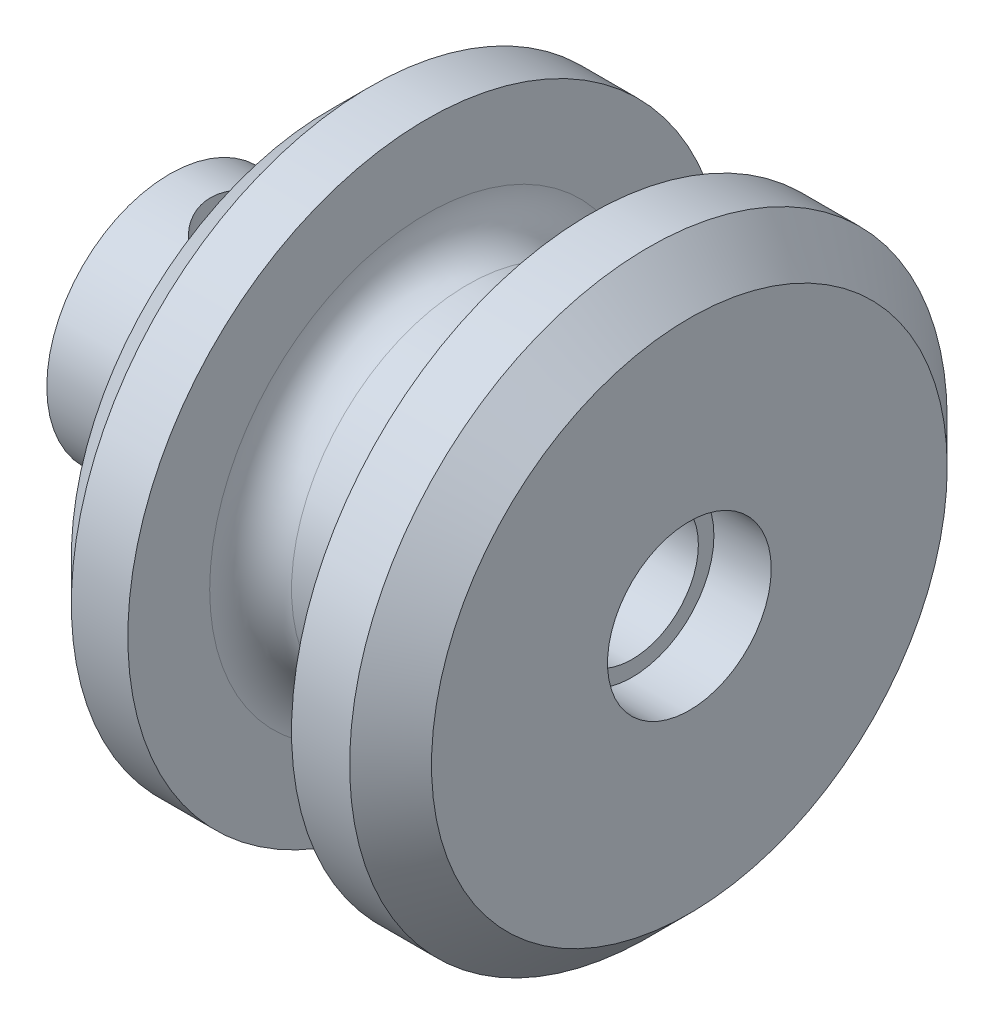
ISO-10303-21;
HEADER;
FILE_DESCRIPTION(('STEP AP214'),'2;1');
FILE_NAME('part.step','',(''),(''),'','','');
FILE_SCHEMA(('AUTOMOTIVE_DESIGN { 1 0 10303 214 1 1 1 1 }'));
ENDSEC;
DATA;
#1=APPLICATION_CONTEXT('core data for automotive mechanical design processes');
#2=APPLICATION_PROTOCOL_DEFINITION('international standard','automotive_design',2000,#1);
#3=PRODUCT_CONTEXT('',#1,'mechanical');
#4=PRODUCT('Part','Part','',(#3));
#5=PRODUCT_RELATED_PRODUCT_CATEGORY('part','',(#4));
#6=PRODUCT_DEFINITION_FORMATION('','',#4);
#7=PRODUCT_DEFINITION_CONTEXT('part definition',#1,'design');
#8=PRODUCT_DEFINITION('design','',#6,#7);
#9=PRODUCT_DEFINITION_SHAPE('','',#8);
#10=(LENGTH_UNIT() NAMED_UNIT(*) SI_UNIT(.MILLI.,.METRE.));
#11=(NAMED_UNIT(*) PLANE_ANGLE_UNIT() SI_UNIT($,.RADIAN.));
#12=(NAMED_UNIT(*) SI_UNIT($,.STERADIAN.) SOLID_ANGLE_UNIT());
#13=UNCERTAINTY_MEASURE_WITH_UNIT(LENGTH_MEASURE(1.E-05),#10,'distance_accuracy_value','');
#14=(GEOMETRIC_REPRESENTATION_CONTEXT(3) GLOBAL_UNCERTAINTY_ASSIGNED_CONTEXT((#13)) GLOBAL_UNIT_ASSIGNED_CONTEXT((#10,
#11,#12)) REPRESENTATION_CONTEXT('',''));
#15=CARTESIAN_POINT('',(0.,0.,0.));
#16=DIRECTION('',(0.,0.,1.));
#17=DIRECTION('',(1.,0.,0.));
#18=AXIS2_PLACEMENT_3D('',#15,#16,#17);
#19=CARTESIAN_POINT('',(0.,0.,0.));
#20=DIRECTION('',(-1.,0.,0.));
#21=DIRECTION('',(0.,0.,1.));
#22=AXIS2_PLACEMENT_3D('',#19,#20,#21);
#23=PLANE('',#22);
#24=CARTESIAN_POINT('',(0.,0.,0.));
#25=DIRECTION('',(1.,0.,0.));
#26=DIRECTION('',(0.,0.,-1.));
#27=AXIS2_PLACEMENT_3D('',#24,#25,#26);
#28=CIRCLE('',#27,1.62);
#29=CARTESIAN_POINT('',(0.,0.,-1.62));
#30=VERTEX_POINT('',#29);
#31=EDGE_CURVE('E454',#30,#30,#28,.T.);
#32=ORIENTED_EDGE('',*,*,#31,.T.);
#33=EDGE_LOOP('',(#32));
#34=FACE_BOUND('',#33,.T.);
#35=CARTESIAN_POINT('',(0.,0.,0.));
#36=DIRECTION('',(1.,0.,0.));
#37=DIRECTION('',(0.,0.,-1.));
#38=AXIS2_PLACEMENT_3D('',#35,#36,#37);
#39=CIRCLE('',#38,3.);
#40=CARTESIAN_POINT('',(0.,0.,-3.));
#41=VERTEX_POINT('',#40);
#42=EDGE_CURVE('E11',#41,#41,#39,.T.);
#43=ORIENTED_EDGE('',*,*,#42,.F.);
#44=EDGE_LOOP('',(#43));
#45=FACE_BOUND('',#44,.T.);
#46=ADVANCED_FACE('F350',(#34,#45),#23,.T.);
#47=CARTESIAN_POINT('',(0.,0.,0.));
#48=DIRECTION('',(1.,0.,0.));
#49=DIRECTION('',(0.,0.,-1.));
#50=AXIS2_PLACEMENT_3D('',#47,#48,#49);
#51=CYLINDRICAL_SURFACE('',#50,3.);
#52=CARTESIAN_POINT('',(2.5,2.71108834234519,-1.28452325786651));
#53=CARTESIAN_POINT('',(2.46677037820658,2.70863288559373,-1.28969830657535));
#54=CARTESIAN_POINT('',(2.4333102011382,2.70677714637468,-1.29358504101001));
#55=CARTESIAN_POINT('',(2.36614828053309,2.70430257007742,-1.29875296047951));
#56=CARTESIAN_POINT('',(2.3324465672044,2.70368358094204,-1.30003446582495));
#57=CARTESIAN_POINT('',(2.23161316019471,2.70373706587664,-1.29992953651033));
#58=CARTESIAN_POINT('',(2.16443658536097,2.70629625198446,-1.29464275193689));
#59=CARTESIAN_POINT('',(2.03208856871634,2.71613788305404,-1.27386032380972));
#60=CARTESIAN_POINT('',(1.9669172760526,2.72342067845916,-1.25836392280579));
#61=CARTESIAN_POINT('',(1.84017654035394,2.74180577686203,-1.21778223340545));
#62=CARTESIAN_POINT('',(1.77860950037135,2.75291059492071,-1.19269062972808));
#63=CARTESIAN_POINT('',(1.65829903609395,2.7781631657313,-1.13265323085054));
#64=CARTESIAN_POINT('',(1.59973730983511,2.79240615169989,-1.09738491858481));
#65=CARTESIAN_POINT('',(1.48903998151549,2.82219927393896,-1.01831967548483));
#66=CARTESIAN_POINT('',(1.43690769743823,2.8377500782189,-0.974518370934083));
#67=CARTESIAN_POINT('',(1.33583958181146,2.87003723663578,-0.875125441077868));
#68=CARTESIAN_POINT('',(1.28757967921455,2.88675862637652,-0.818838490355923));
#69=CARTESIAN_POINT('',(1.20110220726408,2.91821029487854,-0.698506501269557));
#70=CARTESIAN_POINT('',(1.16288437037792,2.9329406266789,-0.634461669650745));
#71=CARTESIAN_POINT('',(1.097856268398,2.9587598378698,-0.500380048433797));
#72=CARTESIAN_POINT('',(1.07100879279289,2.96986056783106,-0.43036371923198));
#73=CARTESIAN_POINT('',(1.02968562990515,2.98719645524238,-0.286205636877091));
#74=CARTESIAN_POINT('',(1.01520217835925,2.99343466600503,-0.212066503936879));
#75=CARTESIAN_POINT('',(0.99990621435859,3.00003376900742,-0.0678761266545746));
#76=CARTESIAN_POINT('',(0.998135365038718,3.00080659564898,0.0020556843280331));
#77=CARTESIAN_POINT('',(1.00581281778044,2.99748358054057,0.141174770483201));
#78=CARTESIAN_POINT('',(1.01525936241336,2.99338850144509,0.210362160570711));
#79=CARTESIAN_POINT('',(1.04444703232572,2.9809810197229,0.343635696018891));
#80=CARTESIAN_POINT('',(1.06382919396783,2.97281592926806,0.407815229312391));
#81=CARTESIAN_POINT('',(1.11196812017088,2.95312354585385,0.53199397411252));
#82=CARTESIAN_POINT('',(1.14072651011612,2.94159566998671,0.591992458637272));
#83=CARTESIAN_POINT('',(1.20846178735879,2.91554962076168,0.709490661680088));
#84=CARTESIAN_POINT('',(1.24788779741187,2.90090823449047,0.766703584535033));
#85=CARTESIAN_POINT('',(1.33514170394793,2.8704148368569,0.873976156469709));
#86=CARTESIAN_POINT('',(1.38297436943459,2.85456214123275,0.924031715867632));
#87=CARTESIAN_POINT('',(1.48976719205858,2.8220045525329,1.01931671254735));
#88=CARTESIAN_POINT('',(1.54928239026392,2.80532110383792,1.06393396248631));
#89=CARTESIAN_POINT('',(1.67548890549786,2.77421776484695,1.14258955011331));
#90=CARTESIAN_POINT('',(1.74217958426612,2.75979767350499,1.17662882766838));
#91=CARTESIAN_POINT('',(1.88038263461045,2.73523498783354,1.23264824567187));
#92=CARTESIAN_POINT('',(1.95183764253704,2.72504946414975,1.25475012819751));
#93=CARTESIAN_POINT('',(2.09800712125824,2.71026751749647,1.28637743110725));
#94=CARTESIAN_POINT('',(2.17271668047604,2.70566295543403,1.29592116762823));
#95=CARTESIAN_POINT('',(2.28988147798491,2.70338789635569,1.30065001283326));
#96=CARTESIAN_POINT('',(2.33216862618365,2.70356689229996,1.30028655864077));
#97=CARTESIAN_POINT('',(2.41642539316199,2.70587672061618,1.2954637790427));
#98=CARTESIAN_POINT('',(2.45839521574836,2.70800616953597,1.29100735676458));
#99=CARTESIAN_POINT('',(2.5,2.71108834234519,1.28452325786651));
#100=B_SPLINE_CURVE_WITH_KNOTS('',3,(#52,#53,#54,#55,#56,#57,#58,#59,#60,#61,#62,#63,#64,#65,
#66,#67,#68,#69,#70,#71,#72,#73,#74,#75,#76,#77,#78,#79,#80,#81,#82,#83,#84,#85,#86,#87,#88,#89,
#90,#91,#92,#93,#94,#95,#96,#97,#98,#99),.UNSPECIFIED.,.F.,.F.,(4,2,2,2,2,2,2,2,2,2,2,2,2,2,2,2,
2,2,2,2,2,2,2,4),(0.,0.101099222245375,0.202186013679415,0.403408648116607,0.604646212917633,
0.806016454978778,1.01464315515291,1.22337707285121,1.45032605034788,1.67726898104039,
1.90346337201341,2.12951561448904,2.33832870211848,2.54710907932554,2.74882857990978,
2.95058306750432,3.162704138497,3.37494593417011,3.60256101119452,3.83015585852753,
4.05538354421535,4.28028236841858,4.40692751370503,4.53348289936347),.UNSPECIFIED.);
#101=CARTESIAN_POINT('',(2.5,2.71108834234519,-1.28452325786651));
#102=VERTEX_POINT('',#101);
#103=CARTESIAN_POINT('',(2.5,2.71108834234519,1.28452325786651));
#104=VERTEX_POINT('',#103);
#105=EDGE_CURVE('E376',#102,#104,#100,.T.);
#106=ORIENTED_EDGE('',*,*,#105,.F.);
#107=CARTESIAN_POINT('',(2.5,0.,0.));
#108=DIRECTION('',(1.,0.,0.));
#109=DIRECTION('',(0.,0.,-1.));
#110=AXIS2_PLACEMENT_3D('',#107,#108,#109);
#111=CIRCLE('',#110,3.);
#112=CARTESIAN_POINT('',(2.5,-2.71108834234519,-1.28452325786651));
#113=VERTEX_POINT('',#112);
#114=EDGE_CURVE('E393',#113,#102,#111,.T.);
#115=ORIENTED_EDGE('',*,*,#114,.F.);
#116=CARTESIAN_POINT('',(2.5,-2.71108834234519,1.28452325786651));
#117=CARTESIAN_POINT('',(2.46677037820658,-2.70863288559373,1.28969830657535));
#118=CARTESIAN_POINT('',(2.4333102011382,-2.70677714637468,1.29358504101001));
#119=CARTESIAN_POINT('',(2.36614828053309,-2.70430257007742,1.29875296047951));
#120=CARTESIAN_POINT('',(2.3324465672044,-2.70368358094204,1.30003446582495));
#121=CARTESIAN_POINT('',(2.23161316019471,-2.70373706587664,1.29992953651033));
#122=CARTESIAN_POINT('',(2.16443658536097,-2.70629625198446,1.29464275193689));
#123=CARTESIAN_POINT('',(2.03208856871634,-2.71613788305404,1.27386032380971));
#124=CARTESIAN_POINT('',(1.9669172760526,-2.72342067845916,1.25836392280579));
#125=CARTESIAN_POINT('',(1.84017654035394,-2.74180577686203,1.21778223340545));
#126=CARTESIAN_POINT('',(1.77860950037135,-2.75291059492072,1.19269062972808));
#127=CARTESIAN_POINT('',(1.65829903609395,-2.7781631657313,1.13265323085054));
#128=CARTESIAN_POINT('',(1.59973730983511,-2.79240615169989,1.09738491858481));
#129=CARTESIAN_POINT('',(1.48903998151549,-2.82219927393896,1.01831967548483));
#130=CARTESIAN_POINT('',(1.43690769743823,-2.83775007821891,0.974518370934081));
#131=CARTESIAN_POINT('',(1.33583958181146,-2.87003723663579,0.875125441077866));
#132=CARTESIAN_POINT('',(1.28757967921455,-2.88675862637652,0.81883849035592));
#133=CARTESIAN_POINT('',(1.20110220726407,-2.91821029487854,0.698506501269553));
#134=CARTESIAN_POINT('',(1.16288437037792,-2.93294062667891,0.634461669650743));
#135=CARTESIAN_POINT('',(1.097856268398,-2.95875983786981,0.500380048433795));
#136=CARTESIAN_POINT('',(1.07100879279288,-2.96986056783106,0.430363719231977));
#137=CARTESIAN_POINT('',(1.02968562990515,-2.98719645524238,0.286205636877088));
#138=CARTESIAN_POINT('',(1.01520217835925,-2.99343466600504,0.212066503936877));
#139=CARTESIAN_POINT('',(0.999906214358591,-3.00003376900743,0.0678761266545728));
#140=CARTESIAN_POINT('',(0.998135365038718,-3.00080659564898,-0.00205568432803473));
#141=CARTESIAN_POINT('',(1.00581281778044,-2.99748358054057,-0.141174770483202));
#142=CARTESIAN_POINT('',(1.01525936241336,-2.9933885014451,-0.210362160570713));
#143=CARTESIAN_POINT('',(1.04444703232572,-2.98098101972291,-0.343635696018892));
#144=CARTESIAN_POINT('',(1.06382919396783,-2.97281592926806,-0.407815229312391));
#145=CARTESIAN_POINT('',(1.11196812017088,-2.95312354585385,-0.531993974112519));
#146=CARTESIAN_POINT('',(1.14072651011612,-2.94159566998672,-0.591992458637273));
#147=CARTESIAN_POINT('',(1.20846178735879,-2.91554962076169,-0.709490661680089));
#148=CARTESIAN_POINT('',(1.24788779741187,-2.90090823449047,-0.766703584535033));
#149=CARTESIAN_POINT('',(1.33514170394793,-2.8704148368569,-0.873976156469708));
#150=CARTESIAN_POINT('',(1.38297436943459,-2.85456214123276,-0.924031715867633));
#151=CARTESIAN_POINT('',(1.48976719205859,-2.8220045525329,-1.01931671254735));
#152=CARTESIAN_POINT('',(1.54928239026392,-2.80532110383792,-1.06393396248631));
#153=CARTESIAN_POINT('',(1.67548890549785,-2.77421776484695,-1.14258955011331));
#154=CARTESIAN_POINT('',(1.74217958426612,-2.759797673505,-1.17662882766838));
#155=CARTESIAN_POINT('',(1.88038263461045,-2.73523498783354,-1.23264824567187));
#156=CARTESIAN_POINT('',(1.95183764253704,-2.72504946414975,-1.25475012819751));
#157=CARTESIAN_POINT('',(2.09800712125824,-2.71026751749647,-1.28637743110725));
#158=CARTESIAN_POINT('',(2.17271668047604,-2.70566295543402,-1.29592116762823));
#159=CARTESIAN_POINT('',(2.28988147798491,-2.70338789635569,-1.30065001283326));
#160=CARTESIAN_POINT('',(2.33216862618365,-2.70356689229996,-1.30028655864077));
#161=CARTESIAN_POINT('',(2.41642539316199,-2.70587672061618,-1.2954637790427));
#162=CARTESIAN_POINT('',(2.45839521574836,-2.70800616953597,-1.29100735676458));
#163=CARTESIAN_POINT('',(2.5,-2.71108834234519,-1.28452325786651));
#164=B_SPLINE_CURVE_WITH_KNOTS('',3,(#116,#117,#118,#119,#120,#121,#122,#123,#124,#125,#126,
#127,#128,#129,#130,#131,#132,#133,#134,#135,#136,#137,#138,#139,#140,#141,#142,#143,#144,#145,
#146,#147,#148,#149,#150,#151,#152,#153,#154,#155,#156,#157,#158,#159,#160,#161,#162,#163),
.UNSPECIFIED.,.F.,.F.,(4,2,2,2,2,2,2,2,2,2,2,2,2,2,2,2,2,2,2,2,2,2,2,4),(0.,0.101099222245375,
0.202186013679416,0.403408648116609,0.604646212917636,0.806016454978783,1.01464315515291,
1.22337707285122,1.45032605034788,1.6772689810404,1.90346337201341,2.12951561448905,
2.33832870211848,2.54710907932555,2.74882857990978,2.95058306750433,3.162704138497,
3.37494593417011,3.60256101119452,3.83015585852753,4.05538354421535,4.28028236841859,
4.40692751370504,4.53348289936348),.UNSPECIFIED.);
#165=CARTESIAN_POINT('',(2.5,-2.71108834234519,1.28452325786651));
#166=VERTEX_POINT('',#165);
#167=EDGE_CURVE('E369',#166,#113,#164,.T.);
#168=ORIENTED_EDGE('',*,*,#167,.F.);
#169=EDGE_CURVE('E362',#104,#166,#111,.T.);
#170=ORIENTED_EDGE('',*,*,#169,.F.);
#171=EDGE_LOOP('',(#106,#115,#168,#170));
#172=FACE_BOUND('',#171,.T.);
#173=ORIENTED_EDGE('',*,*,#42,.T.);
#174=EDGE_LOOP('',(#173));
#175=FACE_BOUND('',#174,.T.);
#176=ADVANCED_FACE('F391',(#172,#175),#51,.T.);
#177=CARTESIAN_POINT('',(3.9,0.,0.));
#178=DIRECTION('',(1.,0.,0.));
#179=DIRECTION('',(0.,0.,-1.));
#180=AXIS2_PLACEMENT_3D('',#177,#178,#179);
#181=CONICAL_SURFACE('',#180,4.4,0.78539816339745);
#182=CARTESIAN_POINT('',(2.4998,2.71085227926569,1.28455438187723));
#183=CARTESIAN_POINT('',(2.5534260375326,2.77416544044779,1.27616763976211));
#184=CARTESIAN_POINT('',(2.60639420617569,2.83763019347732,1.26453176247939));
#185=CARTESIAN_POINT('',(2.71096526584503,2.96440696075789,1.23454718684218));
#186=CARTESIAN_POINT('',(2.7625638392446,3.02771802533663,1.21617946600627));
#187=CARTESIAN_POINT('',(2.86469952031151,3.15418214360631,1.1722782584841));
#188=CARTESIAN_POINT('',(2.91521403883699,3.21732239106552,1.14665452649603));
#189=CARTESIAN_POINT('',(3.01400563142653,3.34171032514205,1.08788682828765));
#190=CARTESIAN_POINT('',(3.06228568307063,3.40296049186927,1.05475323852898));
#191=CARTESIAN_POINT('',(3.15575315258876,3.52222067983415,0.980424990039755));
#192=CARTESIAN_POINT('',(3.20095702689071,3.58024757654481,0.939278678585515));
#193=CARTESIAN_POINT('',(3.28742094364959,3.69173812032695,0.847905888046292));
#194=CARTESIAN_POINT('',(3.32869198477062,3.74521444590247,0.797705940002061));
#195=CARTESIAN_POINT('',(3.39777127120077,3.83502705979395,0.698404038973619));
#196=CARTESIAN_POINT('',(3.42660605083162,3.87263120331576,0.651180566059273));
#197=CARTESIAN_POINT('',(3.47936639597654,3.94158080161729,0.549856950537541));
#198=CARTESIAN_POINT('',(3.50329982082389,3.97293627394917,0.495768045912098));
#199=CARTESIAN_POINT('',(3.53905561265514,4.01984629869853,0.395945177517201));
#200=CARTESIAN_POINT('',(3.5524088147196,4.0373892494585,0.351703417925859));
#201=CARTESIAN_POINT('',(3.57456042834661,4.06651120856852,0.260200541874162));
#202=CARTESIAN_POINT('',(3.58336298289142,4.07809564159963,0.212942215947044));
#203=CARTESIAN_POINT('',(3.59571870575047,4.09436051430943,0.116204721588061));
#204=CARTESIAN_POINT('',(3.59923507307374,4.09899255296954,0.0667124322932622));
#205=CARTESIAN_POINT('',(3.60053950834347,4.10071055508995,-0.0324760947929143));
#206=CARTESIAN_POINT('',(3.59832891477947,4.09779828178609,-0.0821722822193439));
#207=CARTESIAN_POINT('',(3.58891710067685,4.08540641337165,-0.175084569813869));
#208=CARTESIAN_POINT('',(3.5822388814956,4.07661508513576,-0.218450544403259));
#209=CARTESIAN_POINT('',(3.56494097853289,4.05386244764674,-0.3029655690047));
#210=CARTESIAN_POINT('',(3.55431948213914,4.03989876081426,-0.344113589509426));
#211=CARTESIAN_POINT('',(3.52466358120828,4.00095426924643,-0.440066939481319));
#212=CARTESIAN_POINT('',(3.50396667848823,3.97380564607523,-0.493475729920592));
#213=CARTESIAN_POINT('',(3.45761366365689,3.91313439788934,-0.594153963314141));
#214=CARTESIAN_POINT('',(3.43194669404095,3.87959782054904,-0.641409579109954));
#215=CARTESIAN_POINT('',(3.36287037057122,3.78958308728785,-0.752685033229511));
#216=CARTESIAN_POINT('',(3.31711868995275,3.73016804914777,-0.812851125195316));
#217=CARTESIAN_POINT('',(3.22024185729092,3.60503268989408,-0.921113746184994));
#218=CARTESIAN_POINT('',(3.16910226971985,3.53929547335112,-0.969176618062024));
#219=CARTESIAN_POINT('',(3.07471833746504,3.41879578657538,-1.04529086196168));
#220=CARTESIAN_POINT('',(3.03218217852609,3.36476367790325,-1.07542066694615));
#221=CARTESIAN_POINT('',(2.94530375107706,3.25511376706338,-1.12969441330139));
#222=CARTESIAN_POINT('',(2.90096028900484,3.19949492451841,-1.15383432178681));
#223=CARTESIAN_POINT('',(2.8108642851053,3.08737575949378,-1.19645206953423));
#224=CARTESIAN_POINT('',(2.76511343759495,3.03087653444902,-1.21493644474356));
#225=CARTESIAN_POINT('',(2.67236735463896,2.91744533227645,-1.24649117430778));
#226=CARTESIAN_POINT('',(2.62537294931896,2.86051366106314,-1.25956504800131));
#227=CARTESIAN_POINT('',(2.56488744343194,2.78811873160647,-1.27279586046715));
#228=CARTESIAN_POINT('',(2.55191805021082,2.77264625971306,-1.27542636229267));
#229=CARTESIAN_POINT('',(2.52591308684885,2.74173076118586,-1.28028829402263));
#230=CARTESIAN_POINT('',(2.51287763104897,2.72628772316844,-1.28252026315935));
#231=CARTESIAN_POINT('',(2.49980000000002,2.71085227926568,-1.2845543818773));
#232=B_SPLINE_CURVE_WITH_KNOTS('',3,(#182,#183,#184,#185,#186,#187,#188,#189,#190,#191,#192,
#193,#194,#195,#196,#197,#198,#199,#200,#201,#202,#203,#204,#205,#206,#207,#208,#209,#210,#211,
#212,#213,#214,#215,#216,#217,#218,#219,#220,#221,#222,#223,#224,#225,#226,#227,#228,#229,#230,
#231),.UNSPECIFIED.,.F.,.F.,(4,2,2,2,2,2,2,2,2,2,2,2,2,2,2,2,2,2,2,2,2,2,2,2,4),(0.,
0.250145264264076,0.501002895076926,0.755128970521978,1.0089060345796,1.26119681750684,
1.51275995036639,1.71283125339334,1.91257918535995,2.06031112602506,2.20790833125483,
2.35652838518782,2.50511370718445,2.63879037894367,2.77252857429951,2.96162166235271,
3.1511325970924,3.43796758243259,3.72559161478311,3.95053376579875,4.1756269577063,
4.40045902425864,4.62514461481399,4.68622159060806,4.74721528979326),.UNSPECIFIED.);
#233=EDGE_CURVE('E394',#104,#102,#232,.T.);
#234=ORIENTED_EDGE('',*,*,#233,.F.);
#235=ORIENTED_EDGE('',*,*,#169,.T.);
#236=CARTESIAN_POINT('',(2.4998,-2.71085227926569,-1.28455438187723));
#237=CARTESIAN_POINT('',(2.55342603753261,-2.77416544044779,-1.27616763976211));
#238=CARTESIAN_POINT('',(2.60639420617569,-2.83763019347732,-1.26453176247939));
#239=CARTESIAN_POINT('',(2.71096526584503,-2.96440696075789,-1.23454718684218));
#240=CARTESIAN_POINT('',(2.7625638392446,-3.02771802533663,-1.21617946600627));
#241=CARTESIAN_POINT('',(2.86469952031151,-3.15418214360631,-1.1722782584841));
#242=CARTESIAN_POINT('',(2.91521403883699,-3.21732239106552,-1.14665452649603));
#243=CARTESIAN_POINT('',(3.01400563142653,-3.34171032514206,-1.08788682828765));
#244=CARTESIAN_POINT('',(3.06228568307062,-3.40296049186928,-1.05475323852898));
#245=CARTESIAN_POINT('',(3.15575315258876,-3.52222067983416,-0.980424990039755));
#246=CARTESIAN_POINT('',(3.20095702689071,-3.58024757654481,-0.939278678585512));
#247=CARTESIAN_POINT('',(3.28742094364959,-3.69173812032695,-0.84790588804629));
#248=CARTESIAN_POINT('',(3.32869198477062,-3.74521444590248,-0.797705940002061));
#249=CARTESIAN_POINT('',(3.39777127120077,-3.83502705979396,-0.698404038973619));
#250=CARTESIAN_POINT('',(3.42660605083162,-3.87263120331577,-0.651180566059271));
#251=CARTESIAN_POINT('',(3.47936639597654,-3.94158080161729,-0.54985695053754));
#252=CARTESIAN_POINT('',(3.50329982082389,-3.97293627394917,-0.495768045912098));
#253=CARTESIAN_POINT('',(3.53905561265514,-4.01984629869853,-0.395945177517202));
#254=CARTESIAN_POINT('',(3.5524088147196,-4.0373892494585,-0.351703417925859));
#255=CARTESIAN_POINT('',(3.57456042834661,-4.06651120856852,-0.260200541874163));
#256=CARTESIAN_POINT('',(3.58336298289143,-4.07809564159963,-0.212942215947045));
#257=CARTESIAN_POINT('',(3.59571870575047,-4.09436051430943,-0.116204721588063));
#258=CARTESIAN_POINT('',(3.59923507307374,-4.09899255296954,-0.066712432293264));
#259=CARTESIAN_POINT('',(3.60053950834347,-4.10071055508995,0.0324760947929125));
#260=CARTESIAN_POINT('',(3.59832891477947,-4.09779828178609,0.082172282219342));
#261=CARTESIAN_POINT('',(3.58891710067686,-4.08540641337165,0.175084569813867));
#262=CARTESIAN_POINT('',(3.5822388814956,-4.07661508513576,0.218450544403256));
#263=CARTESIAN_POINT('',(3.56494097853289,-4.05386244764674,0.302965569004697));
#264=CARTESIAN_POINT('',(3.55431948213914,-4.03989876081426,0.344113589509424));
#265=CARTESIAN_POINT('',(3.52466358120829,-4.00095426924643,0.440066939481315));
#266=CARTESIAN_POINT('',(3.50396667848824,-3.97380564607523,0.493475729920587));
#267=CARTESIAN_POINT('',(3.45761366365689,-3.91313439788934,0.594153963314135));
#268=CARTESIAN_POINT('',(3.43194669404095,-3.87959782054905,0.64140957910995));
#269=CARTESIAN_POINT('',(3.36287037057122,-3.78958308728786,0.752685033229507));
#270=CARTESIAN_POINT('',(3.31711868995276,-3.73016804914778,0.812851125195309));
#271=CARTESIAN_POINT('',(3.22024185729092,-3.60503268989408,0.921113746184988));
#272=CARTESIAN_POINT('',(3.16910226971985,-3.53929547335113,0.96917661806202));
#273=CARTESIAN_POINT('',(3.07471833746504,-3.41879578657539,1.04529086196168));
#274=CARTESIAN_POINT('',(3.0321821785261,-3.36476367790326,1.07542066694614));
#275=CARTESIAN_POINT('',(2.94530375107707,-3.25511376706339,1.12969441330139));
#276=CARTESIAN_POINT('',(2.90096028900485,-3.19949492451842,1.1538343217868));
#277=CARTESIAN_POINT('',(2.81086428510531,-3.08737575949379,1.19645206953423));
#278=CARTESIAN_POINT('',(2.76511343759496,-3.03087653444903,1.21493644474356));
#279=CARTESIAN_POINT('',(2.67236735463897,-2.91744533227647,1.24649117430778));
#280=CARTESIAN_POINT('',(2.62537294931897,-2.86051366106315,1.25956504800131));
#281=CARTESIAN_POINT('',(2.56488744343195,-2.78811873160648,1.27279586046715));
#282=CARTESIAN_POINT('',(2.55191805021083,-2.77264625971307,1.27542636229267));
#283=CARTESIAN_POINT('',(2.52591308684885,-2.74173076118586,1.28028829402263));
#284=CARTESIAN_POINT('',(2.51287763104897,-2.72628772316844,1.28252026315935));
#285=CARTESIAN_POINT('',(2.49980000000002,-2.71085227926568,1.2845543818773));
#286=B_SPLINE_CURVE_WITH_KNOTS('',3,(#236,#237,#238,#239,#240,#241,#242,#243,#244,#245,#246,
#247,#248,#249,#250,#251,#252,#253,#254,#255,#256,#257,#258,#259,#260,#261,#262,#263,#264,#265,
#266,#267,#268,#269,#270,#271,#272,#273,#274,#275,#276,#277,#278,#279,#280,#281,#282,#283,#284,
#285),.UNSPECIFIED.,.F.,.F.,(4,2,2,2,2,2,2,2,2,2,2,2,2,2,2,2,2,2,2,2,2,2,2,2,4),(0.,
0.250145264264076,0.501002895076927,0.755128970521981,1.00890603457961,1.26119681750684,
1.51275995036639,1.71283125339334,1.91257918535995,2.06031112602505,2.20790833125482,
2.35652838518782,2.50511370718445,2.63879037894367,2.77252857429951,2.96162166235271,
3.15113259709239,3.43796758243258,3.7255916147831,3.95053376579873,4.17562695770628,
4.40045902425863,4.62514461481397,4.68622159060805,4.74721528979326),.UNSPECIFIED.);
#287=EDGE_CURVE('E381',#113,#166,#286,.T.);
#288=ORIENTED_EDGE('',*,*,#287,.F.);
#289=ORIENTED_EDGE('',*,*,#114,.T.);
#290=EDGE_LOOP('',(#234,#235,#288,#289));
#291=FACE_BOUND('',#290,.T.);
#292=CARTESIAN_POINT('',(3.9,0.,0.));
#293=DIRECTION('',(1.,0.,0.));
#294=DIRECTION('',(0.,0.,-1.));
#295=AXIS2_PLACEMENT_3D('',#292,#293,#294);
#296=CIRCLE('',#295,4.4);
#297=CARTESIAN_POINT('',(3.9,0.,-4.4));
#298=VERTEX_POINT('',#297);
#299=EDGE_CURVE('E399',#298,#298,#296,.T.);
#300=ORIENTED_EDGE('',*,*,#299,.F.);
#301=EDGE_LOOP('',(#300));
#302=FACE_BOUND('',#301,.T.);
#303=ADVANCED_FACE('F396',(#291,#302),#181,.T.);
#304=CARTESIAN_POINT('',(3.9,4.4,0.));
#305=DIRECTION('',(-1.,0.,0.));
#306=DIRECTION('',(0.,0.,1.));
#307=AXIS2_PLACEMENT_3D('',#304,#305,#306);
#308=PLANE('',#307);
#309=ORIENTED_EDGE('',*,*,#299,.T.);
#310=EDGE_LOOP('',(#309));
#311=FACE_BOUND('',#310,.T.);
#312=CARTESIAN_POINT('',(3.9,0.,0.));
#313=DIRECTION('',(1.,0.,0.));
#314=DIRECTION('',(0.,0.,-1.));
#315=AXIS2_PLACEMENT_3D('',#312,#313,#314);
#316=CIRCLE('',#315,6.3);
#317=CARTESIAN_POINT('',(3.9,0.,-6.3));
#318=VERTEX_POINT('',#317);
#319=EDGE_CURVE('E490',#318,#318,#316,.T.);
#320=ORIENTED_EDGE('',*,*,#319,.F.);
#321=EDGE_LOOP('',(#320));
#322=FACE_BOUND('',#321,.T.);
#323=ADVANCED_FACE('F439',(#311,#322),#308,.T.);
#324=CARTESIAN_POINT('',(4.9,0.,0.));
#325=DIRECTION('',(1.,0.,0.));
#326=DIRECTION('',(0.,0.,-1.));
#327=AXIS2_PLACEMENT_3D('',#324,#325,#326);
#328=CONICAL_SURFACE('',#327,7.3,0.78539816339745);
#329=ORIENTED_EDGE('',*,*,#319,.T.);
#330=EDGE_LOOP('',(#329));
#331=FACE_BOUND('',#330,.T.);
#332=CARTESIAN_POINT('',(4.9,0.,0.));
#333=DIRECTION('',(1.,0.,0.));
#334=DIRECTION('',(0.,0.,-1.));
#335=AXIS2_PLACEMENT_3D('',#332,#333,#334);
#336=CIRCLE('',#335,7.3);
#337=CARTESIAN_POINT('',(4.9,0.,-7.3));
#338=VERTEX_POINT('',#337);
#339=EDGE_CURVE('E488',#338,#338,#336,.T.);
#340=ORIENTED_EDGE('',*,*,#339,.F.);
#341=EDGE_LOOP('',(#340));
#342=FACE_BOUND('',#341,.T.);
#343=ADVANCED_FACE('F499',(#331,#342),#328,.T.);
#344=CARTESIAN_POINT('',(0.,0.,0.));
#345=DIRECTION('',(1.,0.,0.));
#346=DIRECTION('',(0.,0.,-1.));
#347=AXIS2_PLACEMENT_3D('',#344,#345,#346);
#348=CYLINDRICAL_SURFACE('',#347,7.3);
#349=ORIENTED_EDGE('',*,*,#339,.T.);
#350=EDGE_LOOP('',(#349));
#351=FACE_BOUND('',#350,.T.);
#352=CARTESIAN_POINT('',(6.28,0.,0.));
#353=DIRECTION('',(1.,0.,0.));
#354=DIRECTION('',(0.,0.,-1.));
#355=AXIS2_PLACEMENT_3D('',#352,#353,#354);
#356=CIRCLE('',#355,7.3);
#357=CARTESIAN_POINT('',(6.28,0.,-7.3));
#358=VERTEX_POINT('',#357);
#359=EDGE_CURVE('E485',#358,#358,#356,.T.);
#360=ORIENTED_EDGE('',*,*,#359,.F.);
#361=EDGE_LOOP('',(#360));
#362=FACE_BOUND('',#361,.T.);
#363=ADVANCED_FACE('F503',(#351,#362),#348,.T.);
#364=CARTESIAN_POINT('',(6.28,7.3,0.));
#365=DIRECTION('',(1.,0.,0.));
#366=DIRECTION('',(0.,0.,-1.));
#367=AXIS2_PLACEMENT_3D('',#364,#365,#366);
#368=PLANE('',#367);
#369=ORIENTED_EDGE('',*,*,#359,.T.);
#370=EDGE_LOOP('',(#369));
#371=FACE_BOUND('',#370,.T.);
#372=CARTESIAN_POINT('',(6.28,0.,0.));
#373=DIRECTION('',(1.,0.,0.));
#374=DIRECTION('',(0.,0.,-1.));
#375=AXIS2_PLACEMENT_3D('',#372,#373,#374);
#376=CIRCLE('',#375,5.30000000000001);
#377=CARTESIAN_POINT('',(6.28,0.,-5.30000000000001));
#378=VERTEX_POINT('',#377);
#379=EDGE_CURVE('E482',#378,#378,#376,.T.);
#380=ORIENTED_EDGE('',*,*,#379,.F.);
#381=EDGE_LOOP('',(#380));
#382=FACE_BOUND('',#381,.T.);
#383=ADVANCED_FACE('F507',(#371,#382),#368,.T.);
#384=CARTESIAN_POINT('',(7.28,0.,0.));
#385=DIRECTION('',(1.,0.,0.));
#386=DIRECTION('',(0.,0.,-1.));
#387=AXIS2_PLACEMENT_3D('',#384,#385,#386);
#388=TOROIDAL_SURFACE('',#387,5.3,1.);
#389=ORIENTED_EDGE('',*,*,#379,.T.);
#390=EDGE_LOOP('',(#389));
#391=FACE_BOUND('',#390,.T.);
#392=CARTESIAN_POINT('',(7.28000000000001,0.,0.));
#393=DIRECTION('',(1.,0.,0.));
#394=DIRECTION('',(0.,0.,-1.));
#395=AXIS2_PLACEMENT_3D('',#392,#393,#394);
#396=CIRCLE('',#395,4.3);
#397=CARTESIAN_POINT('',(7.28000000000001,0.,-4.3));
#398=VERTEX_POINT('',#397);
#399=EDGE_CURVE('E479',#398,#398,#396,.T.);
#400=ORIENTED_EDGE('',*,*,#399,.F.);
#401=EDGE_LOOP('',(#400));
#402=FACE_BOUND('',#401,.T.);
#403=ADVANCED_FACE('F514',(#391,#402),#388,.F.);
#404=CARTESIAN_POINT('',(0.,0.,0.));
#405=DIRECTION('',(1.,0.,0.));
#406=DIRECTION('',(0.,0.,-1.));
#407=AXIS2_PLACEMENT_3D('',#404,#405,#406);
#408=CYLINDRICAL_SURFACE('',#407,4.3);
#409=ORIENTED_EDGE('',*,*,#399,.T.);
#410=EDGE_LOOP('',(#409));
#411=FACE_BOUND('',#410,.T.);
#412=CARTESIAN_POINT('',(9.28,0.,0.));
#413=DIRECTION('',(1.,0.,0.));
#414=DIRECTION('',(0.,0.,-1.));
#415=AXIS2_PLACEMENT_3D('',#412,#413,#414);
#416=CIRCLE('',#415,4.3);
#417=CARTESIAN_POINT('',(9.28,0.,-4.3));
#418=VERTEX_POINT('',#417);
#419=EDGE_CURVE('E476',#418,#418,#416,.T.);
#420=ORIENTED_EDGE('',*,*,#419,.F.);
#421=EDGE_LOOP('',(#420));
#422=FACE_BOUND('',#421,.T.);
#423=ADVANCED_FACE('F518',(#411,#422),#408,.T.);
#424=CARTESIAN_POINT('',(9.28,0.,0.));
#425=DIRECTION('',(1.,0.,0.));
#426=DIRECTION('',(0.,0.,-1.));
#427=AXIS2_PLACEMENT_3D('',#424,#425,#426);
#428=TOROIDAL_SURFACE('',#427,5.3,1.);
#429=ORIENTED_EDGE('',*,*,#419,.T.);
#430=EDGE_LOOP('',(#429));
#431=FACE_BOUND('',#430,.T.);
#432=CARTESIAN_POINT('',(10.28,0.,0.));
#433=DIRECTION('',(1.,0.,0.));
#434=DIRECTION('',(0.,0.,-1.));
#435=AXIS2_PLACEMENT_3D('',#432,#433,#434);
#436=CIRCLE('',#435,5.3);
#437=CARTESIAN_POINT('',(10.28,0.,-5.3));
#438=VERTEX_POINT('',#437);
#439=EDGE_CURVE('E473',#438,#438,#436,.T.);
#440=ORIENTED_EDGE('',*,*,#439,.F.);
#441=EDGE_LOOP('',(#440));
#442=FACE_BOUND('',#441,.T.);
#443=ADVANCED_FACE('F522',(#431,#442),#428,.F.);
#444=CARTESIAN_POINT('',(10.28,5.3,0.));
#445=DIRECTION('',(-1.,0.,0.));
#446=DIRECTION('',(0.,0.,1.));
#447=AXIS2_PLACEMENT_3D('',#444,#445,#446);
#448=PLANE('',#447);
#449=ORIENTED_EDGE('',*,*,#439,.T.);
#450=EDGE_LOOP('',(#449));
#451=FACE_BOUND('',#450,.T.);
#452=CARTESIAN_POINT('',(10.28,0.,0.));
#453=DIRECTION('',(1.,0.,0.));
#454=DIRECTION('',(0.,0.,-1.));
#455=AXIS2_PLACEMENT_3D('',#452,#453,#454);
#456=CIRCLE('',#455,7.3);
#457=CARTESIAN_POINT('',(10.28,0.,-7.3));
#458=VERTEX_POINT('',#457);
#459=EDGE_CURVE('E470',#458,#458,#456,.T.);
#460=ORIENTED_EDGE('',*,*,#459,.F.);
#461=EDGE_LOOP('',(#460));
#462=FACE_BOUND('',#461,.T.);
#463=ADVANCED_FACE('F526',(#451,#462),#448,.T.);
#464=CARTESIAN_POINT('',(0.,0.,0.));
#465=DIRECTION('',(1.,0.,0.));
#466=DIRECTION('',(0.,0.,-1.));
#467=AXIS2_PLACEMENT_3D('',#464,#465,#466);
#468=CYLINDRICAL_SURFACE('',#467,7.3);
#469=ORIENTED_EDGE('',*,*,#459,.T.);
#470=EDGE_LOOP('',(#469));
#471=FACE_BOUND('',#470,.T.);
#472=CARTESIAN_POINT('',(11.7,0.,0.));
#473=DIRECTION('',(1.,0.,0.));
#474=DIRECTION('',(0.,0.,-1.));
#475=AXIS2_PLACEMENT_3D('',#472,#473,#474);
#476=CIRCLE('',#475,7.3);
#477=CARTESIAN_POINT('',(11.7,0.,-7.3));
#478=VERTEX_POINT('',#477);
#479=EDGE_CURVE('E461',#478,#478,#476,.T.);
#480=ORIENTED_EDGE('',*,*,#479,.F.);
#481=EDGE_LOOP('',(#480));
#482=FACE_BOUND('',#481,.T.);
#483=ADVANCED_FACE('F530',(#471,#482),#468,.T.);
#484=CARTESIAN_POINT('',(12.7,0.,0.));
#485=DIRECTION('',(-1.,0.,0.));
#486=DIRECTION('',(0.,0.,1.));
#487=AXIS2_PLACEMENT_3D('',#484,#485,#486);
#488=CONICAL_SURFACE('',#487,6.3,0.78539816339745);
#489=ORIENTED_EDGE('',*,*,#479,.T.);
#490=EDGE_LOOP('',(#489));
#491=FACE_BOUND('',#490,.T.);
#492=CARTESIAN_POINT('',(12.7,0.,0.));
#493=DIRECTION('',(1.,0.,0.));
#494=DIRECTION('',(0.,0.,-1.));
#495=AXIS2_PLACEMENT_3D('',#492,#493,#494);
#496=CIRCLE('',#495,6.3);
#497=CARTESIAN_POINT('',(12.7,0.,-6.3));
#498=VERTEX_POINT('',#497);
#499=EDGE_CURVE('E457',#498,#498,#496,.T.);
#500=ORIENTED_EDGE('',*,*,#499,.F.);
#501=EDGE_LOOP('',(#500));
#502=FACE_BOUND('',#501,.T.);
#503=ADVANCED_FACE('F534',(#491,#502),#488,.T.);
#504=CARTESIAN_POINT('',(12.7,6.3,0.));
#505=DIRECTION('',(1.,0.,0.));
#506=DIRECTION('',(0.,0.,-1.));
#507=AXIS2_PLACEMENT_3D('',#504,#505,#506);
#508=PLANE('',#507);
#509=CARTESIAN_POINT('',(12.7,0.,0.));
#510=DIRECTION('',(1.,0.,0.));
#511=DIRECTION('',(0.,0.,-1.));
#512=AXIS2_PLACEMENT_3D('',#509,#510,#511);
#513=CIRCLE('',#512,2.);
#514=CARTESIAN_POINT('',(12.7,0.,-2.));
#515=VERTEX_POINT('',#514);
#516=EDGE_CURVE('E550',#515,#515,#513,.T.);
#517=ORIENTED_EDGE('',*,*,#516,.F.);
#518=EDGE_LOOP('',(#517));
#519=FACE_BOUND('',#518,.T.);
#520=ORIENTED_EDGE('',*,*,#499,.T.);
#521=EDGE_LOOP('',(#520));
#522=FACE_BOUND('',#521,.T.);
#523=ADVANCED_FACE('F537',(#519,#522),#508,.T.);
#524=CARTESIAN_POINT('',(0.,0.,0.));
#525=DIRECTION('',(1.,0.,0.));
#526=DIRECTION('',(0.,0.,-1.));
#527=AXIS2_PLACEMENT_3D('',#524,#525,#526);
#528=CYLINDRICAL_SURFACE('',#527,1.62);
#529=CARTESIAN_POINT('',(2.3,-0.966643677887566,1.3));
#530=CARTESIAN_POINT('',(2.25139474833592,-0.966658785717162,1.29999336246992));
#531=CARTESIAN_POINT('',(2.20271949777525,-0.970386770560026,1.29724218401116));
#532=CARTESIAN_POINT('',(2.1069009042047,-0.984586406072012,1.28649151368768));
#533=CARTESIAN_POINT('',(2.05976328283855,-0.99508076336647,1.27847434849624));
#534=CARTESIAN_POINT('',(1.95189491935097,-1.02568695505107,1.25413850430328));
#535=CARTESIAN_POINT('',(1.8922075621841,-1.04788243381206,1.23589273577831));
#536=CARTESIAN_POINT('',(1.777851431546,-1.097435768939,1.19211258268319));
#537=CARTESIAN_POINT('',(1.72319767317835,-1.1248083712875,1.16655726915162));
#538=CARTESIAN_POINT('',(1.59958950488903,-1.19221729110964,1.09821861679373));
#539=CARTESIAN_POINT('',(1.53274714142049,-1.23321465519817,1.05255456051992));
#540=CARTESIAN_POINT('',(1.40831823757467,-1.31426724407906,0.949428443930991));
#541=CARTESIAN_POINT('',(1.35072392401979,-1.3543232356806,0.891976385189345));
#542=CARTESIAN_POINT('',(1.25645210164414,-1.42216556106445,0.778029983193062));
#543=CARTESIAN_POINT('',(1.2178920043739,-1.45080902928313,0.723609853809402));
#544=CARTESIAN_POINT('',(1.14881426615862,-1.50303607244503,0.607704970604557));
#545=CARTESIAN_POINT('',(1.11828409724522,-1.52662751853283,0.546231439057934));
#546=CARTESIAN_POINT('',(1.07100403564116,-1.56353819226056,0.427727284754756));
#547=CARTESIAN_POINT('',(1.0528210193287,-1.57790370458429,0.371598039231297));
#548=CARTESIAN_POINT('',(1.02412138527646,-1.60068397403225,0.256239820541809));
#549=CARTESIAN_POINT('',(1.01360055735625,-1.6091019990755,0.197012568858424));
#550=CARTESIAN_POINT('',(1.00086600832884,-1.61930056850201,0.0768795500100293));
#551=CARTESIAN_POINT('',(0.998681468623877,-1.62105779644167,0.0159686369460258));
#552=CARTESIAN_POINT('',(1.00285594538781,-1.61770860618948,-0.105367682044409));
#553=CARTESIAN_POINT('',(1.00921530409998,-1.61260191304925,-0.16579306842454));
#554=CARTESIAN_POINT('',(1.02945851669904,-1.59644647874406,-0.280994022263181));
#555=CARTESIAN_POINT('',(1.04290606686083,-1.58574254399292,-0.335897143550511));
#556=CARTESIAN_POINT('',(1.07632035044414,-1.55938663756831,-0.442410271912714));
#557=CARTESIAN_POINT('',(1.0962887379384,-1.54373341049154,-0.494019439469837));
#558=CARTESIAN_POINT('',(1.14410596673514,-1.50673131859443,-0.597901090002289));
#559=CARTESIAN_POINT('',(1.17252586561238,-1.48498088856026,-0.649764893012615));
#560=CARTESIAN_POINT('',(1.23520159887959,-1.43797290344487,-0.74806955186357));
#561=CARTESIAN_POINT('',(1.26946062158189,-1.4127134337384,-0.794507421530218));
#562=CARTESIAN_POINT('',(1.35063375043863,-1.35452271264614,-0.890756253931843));
#563=CARTESIAN_POINT('',(1.39870050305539,-1.32108388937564,-0.939286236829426));
#564=CARTESIAN_POINT('',(1.50144615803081,-1.25323181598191,-1.0280720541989));
#565=CARTESIAN_POINT('',(1.55613331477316,-1.21881739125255,-1.06831738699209));
#566=CARTESIAN_POINT('',(1.66672269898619,-1.15481039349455,-1.13701952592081));
#567=CARTESIAN_POINT('',(1.72207894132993,-1.1250618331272,-1.16620868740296));
#568=CARTESIAN_POINT('',(1.83828205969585,-1.07003479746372,-1.21688820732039));
#569=CARTESIAN_POINT('',(1.89911657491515,-1.04474662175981,-1.23839537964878));
#570=CARTESIAN_POINT('',(2.00652666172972,-1.00936596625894,-1.26725516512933));
#571=CARTESIAN_POINT('',(2.05170793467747,-0.99699240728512,-1.27692770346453));
#572=CARTESIAN_POINT('',(2.14399773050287,-0.978116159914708,-1.29144651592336));
#573=CARTESIAN_POINT('',(2.19110162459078,-0.971600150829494,-1.29630374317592));
#574=CARTESIAN_POINT('',(2.28632119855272,-0.965569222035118,-1.30080520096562));
#575=CARTESIAN_POINT('',(2.33444128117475,-0.966096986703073,-1.30041764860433));
#576=CARTESIAN_POINT('',(2.42977723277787,-0.974152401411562,-1.29439107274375));
#577=CARTESIAN_POINT('',(2.47699175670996,-0.981689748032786,-1.28874477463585));
#578=CARTESIAN_POINT('',(2.580694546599,-1.00500296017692,-1.27068090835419));
#579=CARTESIAN_POINT('',(2.63658173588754,-1.02235747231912,-1.25693215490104));
#580=CARTESIAN_POINT('',(2.74427146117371,-1.06266809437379,-1.22304130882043));
#581=CARTESIAN_POINT('',(2.79606114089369,-1.08564097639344,-1.20288001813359));
#582=CARTESIAN_POINT('',(2.91881977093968,-1.14598029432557,-1.14609940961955));
#583=CARTESIAN_POINT('',(2.98742515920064,-1.18505220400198,-1.1061932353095));
#584=CARTESIAN_POINT('',(3.11607800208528,-1.26405412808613,-1.01500412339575));
#585=CARTESIAN_POINT('',(3.17611491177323,-1.30398513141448,-0.963707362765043));
#586=CARTESIAN_POINT('',(3.28775048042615,-1.38145600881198,-0.849027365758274));
#587=CARTESIAN_POINT('',(3.33920411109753,-1.41894929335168,-0.785469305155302));
#588=CARTESIAN_POINT('',(3.43039651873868,-1.48703880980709,-0.64730192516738));
#589=CARTESIAN_POINT('',(3.47017310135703,-1.5176572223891,-0.572729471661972));
#590=CARTESIAN_POINT('',(3.52473775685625,-1.56019115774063,-0.439769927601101));
#591=CARTESIAN_POINT('',(3.54344814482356,-1.57495471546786,-0.383892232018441));
#592=CARTESIAN_POINT('',(3.5732582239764,-1.59859392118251,-0.268939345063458));
#593=CARTESIAN_POINT('',(3.58436374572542,-1.60747407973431,-0.209866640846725));
#594=CARTESIAN_POINT('',(3.59829854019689,-1.61862952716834,-0.0898925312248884));
#595=CARTESIAN_POINT('',(3.60109622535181,-1.62087960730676,-0.028985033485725));
#596=CARTESIAN_POINT('',(3.59812818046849,-1.6184980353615,0.0924869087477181));
#597=CARTESIAN_POINT('',(3.59236204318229,-1.61386605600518,0.153051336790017));
#598=CARTESIAN_POINT('',(3.57322621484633,-1.59858517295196,0.26857388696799));
#599=CARTESIAN_POINT('',(3.56030395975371,-1.58829055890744,0.32365551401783));
#600=CARTESIAN_POINT('',(3.52788637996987,-1.56269201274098,0.430604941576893));
#601=CARTESIAN_POINT('',(3.50838934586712,-1.54738677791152,0.482471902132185));
#602=CARTESIAN_POINT('',(3.46162652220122,-1.51113793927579,0.586662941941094));
#603=CARTESIAN_POINT('',(3.43381944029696,-1.48981083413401,0.638607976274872));
#604=CARTESIAN_POINT('',(3.37236830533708,-1.44359407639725,0.737159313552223));
#605=CARTESIAN_POINT('',(3.33872134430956,-1.41870265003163,0.783762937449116));
#606=CARTESIAN_POINT('',(3.25899468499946,-1.36130469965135,0.880348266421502));
#607=CARTESIAN_POINT('',(3.21177875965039,-1.32828018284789,0.929082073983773));
#608=CARTESIAN_POINT('',(3.11079718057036,-1.26109577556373,1.01841173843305));
#609=CARTESIAN_POINT('',(3.05702292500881,-1.22693443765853,1.05899671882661));
#610=CARTESIAN_POINT('',(2.94673686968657,-1.16223580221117,1.12949031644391));
#611=CARTESIAN_POINT('',(2.89060488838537,-1.13160535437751,1.15990687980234));
#612=CARTESIAN_POINT('',(2.77260153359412,-1.07475088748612,1.21276927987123));
#613=CARTESIAN_POINT('',(2.7107412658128,-1.04851860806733,1.23523014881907));
#614=CARTESIAN_POINT('',(2.60125051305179,-1.01162143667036,1.26546819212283));
#615=CARTESIAN_POINT('',(2.55507490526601,-0.998649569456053,1.27563608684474));
#616=CARTESIAN_POINT('',(2.46068552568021,-0.978837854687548,1.29090700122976));
#617=CARTESIAN_POINT('',(2.41248031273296,-0.97197452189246,1.29602942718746));
#618=CARTESIAN_POINT('',(2.34268422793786,-0.967346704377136,1.29947634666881));
#619=CARTESIAN_POINT('',(2.32134886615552,-0.966637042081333,1.30000291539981));
#620=CARTESIAN_POINT('',(2.3,-0.966643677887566,1.3));
#621=B_SPLINE_CURVE_WITH_KNOTS('',3,(#529,#530,#531,#532,#533,#534,#535,#536,#537,#538,#539,
#540,#541,#542,#543,#544,#545,#546,#547,#548,#549,#550,#551,#552,#553,#554,#555,#556,#557,#558,
#559,#560,#561,#562,#563,#564,#565,#566,#567,#568,#569,#570,#571,#572,#573,#574,#575,#576,#577,
#578,#579,#580,#581,#582,#583,#584,#585,#586,#587,#588,#589,#590,#591,#592,#593,#594,#595,#596,
#597,#598,#599,#600,#601,#602,#603,#604,#605,#606,#607,#608,#609,#610,#611,#612,#613,#614,#615,
#616,#617,#618,#619,#620),.UNSPECIFIED.,.T.,.F.,(4,2,2,2,2,2,2,2,2,2,2,2,2,2,2,2,2,2,2,2,2,2,2,
2,2,2,2,2,2,2,2,2,2,2,2,2,2,2,2,2,2,2,2,2,2,4),(0.,0.145739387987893,0.291970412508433,
0.48958224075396,0.687765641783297,0.958675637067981,1.22935672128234,1.44630042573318,
1.66290362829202,1.84430791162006,2.0256124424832,2.20755105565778,2.38949695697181,
2.56136462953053,2.73327593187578,2.92162976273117,3.1100867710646,3.33742804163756,
3.56505574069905,3.77232776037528,3.97914329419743,4.12212581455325,4.26478234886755,
4.40830375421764,4.55202399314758,4.73135718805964,4.9112324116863,5.17526638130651,
5.43962253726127,5.70807137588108,5.97564124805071,6.15714519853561,6.33850983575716,
6.52056316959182,6.7026251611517,6.87441326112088,7.0462460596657,7.23354503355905,
7.420937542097,7.64652898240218,7.87241955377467,8.08422383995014,8.29562576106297,
8.44218828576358,8.58818486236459,8.65219791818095),.UNSPECIFIED.);
#622=CARTESIAN_POINT('',(2.3,-0.966643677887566,1.3));
#623=VERTEX_POINT('',#622);
#624=EDGE_CURVE('E353',#623,#623,#621,.T.);
#625=ORIENTED_EDGE('',*,*,#624,.T.);
#626=EDGE_LOOP('',(#625));
#627=FACE_BOUND('',#626,.T.);
#628=CARTESIAN_POINT('',(2.3,0.966643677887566,1.3));
#629=CARTESIAN_POINT('',(2.34860525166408,0.966658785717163,1.29999336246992));
#630=CARTESIAN_POINT('',(2.39728050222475,0.970386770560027,1.29724218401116));
#631=CARTESIAN_POINT('',(2.4930990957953,0.984586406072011,1.28649151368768));
#632=CARTESIAN_POINT('',(2.54023671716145,0.99508076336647,1.27847434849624));
#633=CARTESIAN_POINT('',(2.64810508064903,1.02568695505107,1.25413850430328));
#634=CARTESIAN_POINT('',(2.7077924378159,1.04788243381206,1.23589273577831));
#635=CARTESIAN_POINT('',(2.822148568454,1.097435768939,1.19211258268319));
#636=CARTESIAN_POINT('',(2.87680232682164,1.1248083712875,1.16655726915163));
#637=CARTESIAN_POINT('',(3.00041049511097,1.19221729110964,1.09821861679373));
#638=CARTESIAN_POINT('',(3.0672528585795,1.23321465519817,1.05255456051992));
#639=CARTESIAN_POINT('',(3.19168176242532,1.31426724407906,0.949428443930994));
#640=CARTESIAN_POINT('',(3.24927607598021,1.3543232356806,0.891976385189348));
#641=CARTESIAN_POINT('',(3.34354789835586,1.42216556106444,0.778029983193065));
#642=CARTESIAN_POINT('',(3.3821079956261,1.45080902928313,0.723609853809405));
#643=CARTESIAN_POINT('',(3.45118573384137,1.50303607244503,0.60770497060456));
#644=CARTESIAN_POINT('',(3.48171590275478,1.52662751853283,0.546231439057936));
#645=CARTESIAN_POINT('',(3.52899596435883,1.56353819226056,0.427727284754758));
#646=CARTESIAN_POINT('',(3.5471789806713,1.57790370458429,0.3715980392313));
#647=CARTESIAN_POINT('',(3.57587861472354,1.60068397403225,0.256239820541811));
#648=CARTESIAN_POINT('',(3.58639944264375,1.6091019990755,0.197012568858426));
#649=CARTESIAN_POINT('',(3.59913399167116,1.61930056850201,0.0768795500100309));
#650=CARTESIAN_POINT('',(3.60131853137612,1.62105779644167,0.0159686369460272));
#651=CARTESIAN_POINT('',(3.59714405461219,1.61770860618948,-0.105367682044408));
#652=CARTESIAN_POINT('',(3.59078469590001,1.61260191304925,-0.165793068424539));
#653=CARTESIAN_POINT('',(3.57054148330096,1.59644647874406,-0.280994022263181));
#654=CARTESIAN_POINT('',(3.55709393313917,1.58574254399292,-0.335897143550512));
#655=CARTESIAN_POINT('',(3.52367964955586,1.55938663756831,-0.442410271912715));
#656=CARTESIAN_POINT('',(3.5037112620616,1.54373341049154,-0.494019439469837));
#657=CARTESIAN_POINT('',(3.45589403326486,1.50673131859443,-0.597901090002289));
#658=CARTESIAN_POINT('',(3.42747413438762,1.48498088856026,-0.649764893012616));
#659=CARTESIAN_POINT('',(3.36479840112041,1.43797290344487,-0.748069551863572));
#660=CARTESIAN_POINT('',(3.33053937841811,1.4127134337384,-0.794507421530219));
#661=CARTESIAN_POINT('',(3.24936624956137,1.35452271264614,-0.890756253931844));
#662=CARTESIAN_POINT('',(3.20129949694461,1.32108388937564,-0.939286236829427));
#663=CARTESIAN_POINT('',(3.09855384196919,1.25323181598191,-1.0280720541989));
#664=CARTESIAN_POINT('',(3.04386668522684,1.21881739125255,-1.06831738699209));
#665=CARTESIAN_POINT('',(2.93327730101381,1.15481039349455,-1.13701952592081));
#666=CARTESIAN_POINT('',(2.87792105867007,1.1250618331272,-1.16620868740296));
#667=CARTESIAN_POINT('',(2.76171794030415,1.07003479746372,-1.21688820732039));
#668=CARTESIAN_POINT('',(2.70088342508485,1.04474662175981,-1.23839537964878));
#669=CARTESIAN_POINT('',(2.59347333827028,1.00936596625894,-1.26725516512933));
#670=CARTESIAN_POINT('',(2.54829206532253,0.996992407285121,-1.27692770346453));
#671=CARTESIAN_POINT('',(2.45600226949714,0.978116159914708,-1.29144651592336));
#672=CARTESIAN_POINT('',(2.40889837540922,0.971600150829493,-1.29630374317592));
#673=CARTESIAN_POINT('',(2.31367880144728,0.965569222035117,-1.30080520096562));
#674=CARTESIAN_POINT('',(2.26555871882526,0.966096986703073,-1.30041764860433));
#675=CARTESIAN_POINT('',(2.17022276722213,0.974152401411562,-1.29439107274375));
#676=CARTESIAN_POINT('',(2.12300824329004,0.981689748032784,-1.28874477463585));
#677=CARTESIAN_POINT('',(2.019305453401,1.00500296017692,-1.27068090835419));
#678=CARTESIAN_POINT('',(1.96341826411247,1.02235747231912,-1.25693215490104));
#679=CARTESIAN_POINT('',(1.8557285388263,1.06266809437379,-1.22304130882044));
#680=CARTESIAN_POINT('',(1.80393885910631,1.08564097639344,-1.20288001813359));
#681=CARTESIAN_POINT('',(1.68118022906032,1.14598029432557,-1.14609940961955));
#682=CARTESIAN_POINT('',(1.61257484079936,1.18505220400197,-1.1061932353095));
#683=CARTESIAN_POINT('',(1.48392199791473,1.26405412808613,-1.01500412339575));
#684=CARTESIAN_POINT('',(1.42388508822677,1.30398513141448,-0.963707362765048));
#685=CARTESIAN_POINT('',(1.31224951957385,1.38145600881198,-0.849027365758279));
#686=CARTESIAN_POINT('',(1.26079588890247,1.41894929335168,-0.785469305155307));
#687=CARTESIAN_POINT('',(1.16960348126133,1.48703880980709,-0.647301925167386));
#688=CARTESIAN_POINT('',(1.12982689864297,1.5176572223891,-0.572729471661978));
#689=CARTESIAN_POINT('',(1.07526224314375,1.56019115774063,-0.439769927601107));
#690=CARTESIAN_POINT('',(1.05655185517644,1.57495471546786,-0.383892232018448));
#691=CARTESIAN_POINT('',(1.0267417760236,1.59859392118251,-0.268939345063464));
#692=CARTESIAN_POINT('',(1.01563625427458,1.60747407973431,-0.20986664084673));
#693=CARTESIAN_POINT('',(1.00170145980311,1.61862952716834,-0.0898925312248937));
#694=CARTESIAN_POINT('',(0.998903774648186,1.62087960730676,-0.0289850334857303));
#695=CARTESIAN_POINT('',(1.00187181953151,1.6184980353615,0.0924869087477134));
#696=CARTESIAN_POINT('',(1.00763795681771,1.61386605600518,0.153051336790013));
#697=CARTESIAN_POINT('',(1.02677378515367,1.59858517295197,0.268573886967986));
#698=CARTESIAN_POINT('',(1.03969604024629,1.58829055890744,0.323655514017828));
#699=CARTESIAN_POINT('',(1.07211362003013,1.56269201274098,0.43060494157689));
#700=CARTESIAN_POINT('',(1.09161065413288,1.54738677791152,0.482471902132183));
#701=CARTESIAN_POINT('',(1.13837347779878,1.51113793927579,0.586662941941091));
#702=CARTESIAN_POINT('',(1.16618055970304,1.48981083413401,0.638607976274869));
#703=CARTESIAN_POINT('',(1.22763169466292,1.44359407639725,0.737159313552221));
#704=CARTESIAN_POINT('',(1.26127865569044,1.41870265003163,0.783762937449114));
#705=CARTESIAN_POINT('',(1.34100531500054,1.36130469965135,0.8803482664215));
#706=CARTESIAN_POINT('',(1.3882212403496,1.32828018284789,0.929082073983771));
#707=CARTESIAN_POINT('',(1.48920281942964,1.26109577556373,1.01841173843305));
#708=CARTESIAN_POINT('',(1.54297707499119,1.22693443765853,1.05899671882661));
#709=CARTESIAN_POINT('',(1.65326313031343,1.16223580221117,1.12949031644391));
#710=CARTESIAN_POINT('',(1.70939511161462,1.13160535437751,1.15990687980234));
#711=CARTESIAN_POINT('',(1.82739846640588,1.07475088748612,1.21276927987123));
#712=CARTESIAN_POINT('',(1.8892587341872,1.04851860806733,1.23523014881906));
#713=CARTESIAN_POINT('',(1.99874948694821,1.01162143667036,1.26546819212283));
#714=CARTESIAN_POINT('',(2.04492509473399,0.998649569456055,1.27563608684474));
#715=CARTESIAN_POINT('',(2.13931447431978,0.978837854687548,1.29090700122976));
#716=CARTESIAN_POINT('',(2.18751968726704,0.971974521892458,1.29602942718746));
#717=CARTESIAN_POINT('',(2.25731577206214,0.967346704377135,1.29947634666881));
#718=CARTESIAN_POINT('',(2.27865113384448,0.966637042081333,1.30000291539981));
#719=CARTESIAN_POINT('',(2.3,0.966643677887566,1.3));
#720=B_SPLINE_CURVE_WITH_KNOTS('',3,(#628,#629,#630,#631,#632,#633,#634,#635,#636,#637,#638,
#639,#640,#641,#642,#643,#644,#645,#646,#647,#648,#649,#650,#651,#652,#653,#654,#655,#656,#657,
#658,#659,#660,#661,#662,#663,#664,#665,#666,#667,#668,#669,#670,#671,#672,#673,#674,#675,#676,
#677,#678,#679,#680,#681,#682,#683,#684,#685,#686,#687,#688,#689,#690,#691,#692,#693,#694,#695,
#696,#697,#698,#699,#700,#701,#702,#703,#704,#705,#706,#707,#708,#709,#710,#711,#712,#713,#714,
#715,#716,#717,#718,#719),.UNSPECIFIED.,.T.,.F.,(4,2,2,2,2,2,2,2,2,2,2,2,2,2,2,2,2,2,2,2,2,2,2,
2,2,2,2,2,2,2,2,2,2,2,2,2,2,2,2,2,2,2,2,2,2,4),(0.,0.145739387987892,0.291970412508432,
0.489582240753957,0.687765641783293,0.958675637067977,1.22935672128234,1.44630042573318,
1.66290362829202,1.84430791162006,2.0256124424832,2.20755105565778,2.3894969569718,
2.56136462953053,2.73327593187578,2.92162976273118,3.1100867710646,3.33742804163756,
3.56505574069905,3.77232776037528,3.97914329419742,4.12212581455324,4.26478234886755,
4.40830375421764,4.55202399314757,4.73135718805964,4.91123241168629,5.17526638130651,
5.43962253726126,5.70807137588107,5.9756412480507,6.1571451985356,6.33850983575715,
6.52056316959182,6.7026251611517,6.87441326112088,7.0462460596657,7.23354503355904,
7.420937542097,7.64652898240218,7.87241955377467,8.08422383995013,8.29562576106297,
8.44218828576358,8.58818486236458,8.65219791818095),.UNSPECIFIED.);
#721=CARTESIAN_POINT('',(2.3,0.966643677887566,1.3));
#722=VERTEX_POINT('',#721);
#723=EDGE_CURVE('E402',#722,#722,#720,.T.);
#724=ORIENTED_EDGE('',*,*,#723,.T.);
#725=EDGE_LOOP('',(#724));
#726=FACE_BOUND('',#725,.T.);
#727=ORIENTED_EDGE('',*,*,#31,.F.);
#728=EDGE_LOOP('',(#727));
#729=FACE_BOUND('',#728,.T.);
#730=CARTESIAN_POINT('',(11.3,0.,0.));
#731=DIRECTION('',(1.,0.,0.));
#732=DIRECTION('',(0.,0.,-1.));
#733=AXIS2_PLACEMENT_3D('',#730,#731,#732);
#734=CIRCLE('',#733,1.62);
#735=CARTESIAN_POINT('',(11.3,0.,-1.62));
#736=VERTEX_POINT('',#735);
#737=EDGE_CURVE('E458',#736,#736,#734,.T.);
#738=ORIENTED_EDGE('',*,*,#737,.T.);
#739=EDGE_LOOP('',(#738));
#740=FACE_BOUND('',#739,.T.);
#741=ADVANCED_FACE('F406',(#627,#726,#729,#740),#528,.F.);
#742=CARTESIAN_POINT('',(11.3,1.62,0.));
#743=DIRECTION('',(-1.,0.,0.));
#744=DIRECTION('',(0.,0.,1.));
#745=AXIS2_PLACEMENT_3D('',#742,#743,#744);
#746=PLANE('',#745);
#747=ORIENTED_EDGE('',*,*,#737,.F.);
#748=EDGE_LOOP('',(#747));
#749=FACE_BOUND('',#748,.T.);
#750=CARTESIAN_POINT('',(11.3,0.,0.));
#751=DIRECTION('',(1.,0.,0.));
#752=DIRECTION('',(0.,0.,-1.));
#753=AXIS2_PLACEMENT_3D('',#750,#751,#752);
#754=CIRCLE('',#753,2.);
#755=CARTESIAN_POINT('',(11.3,0.,-2.));
#756=VERTEX_POINT('',#755);
#757=EDGE_CURVE('E464',#756,#756,#754,.T.);
#758=ORIENTED_EDGE('',*,*,#757,.T.);
#759=EDGE_LOOP('',(#758));
#760=FACE_BOUND('',#759,.T.);
#761=ADVANCED_FACE('F545',(#749,#760),#746,.F.);
#762=CARTESIAN_POINT('',(0.,0.,0.));
#763=DIRECTION('',(1.,0.,0.));
#764=DIRECTION('',(0.,0.,-1.));
#765=AXIS2_PLACEMENT_3D('',#762,#763,#764);
#766=CYLINDRICAL_SURFACE('',#765,2.);
#767=ORIENTED_EDGE('',*,*,#757,.F.);
#768=EDGE_LOOP('',(#767));
#769=FACE_BOUND('',#768,.T.);
#770=ORIENTED_EDGE('',*,*,#516,.T.);
#771=EDGE_LOOP('',(#770));
#772=FACE_BOUND('',#771,.T.);
#773=ADVANCED_FACE('F414',(#769,#772),#766,.F.);
#774=CARTESIAN_POINT('',(2.3,-7.3,0.));
#775=DIRECTION('',(0.,1.,0.));
#776=DIRECTION('',(0.,0.,1.));
#777=AXIS2_PLACEMENT_3D('',#774,#775,#776);
#778=CYLINDRICAL_SURFACE('',#777,1.3);
#779=ORIENTED_EDGE('',*,*,#105,.T.);
#780=ORIENTED_EDGE('',*,*,#233,.T.);
#781=EDGE_LOOP('',(#779,#780));
#782=FACE_BOUND('',#781,.T.);
#783=ORIENTED_EDGE('',*,*,#723,.F.);
#784=EDGE_LOOP('',(#783));
#785=FACE_BOUND('',#784,.T.);
#786=ADVANCED_FACE('F413',(#782,#785),#778,.F.);
#787=ORIENTED_EDGE('',*,*,#167,.T.);
#788=ORIENTED_EDGE('',*,*,#287,.T.);
#789=EDGE_LOOP('',(#787,#788));
#790=FACE_BOUND('',#789,.T.);
#791=ORIENTED_EDGE('',*,*,#624,.F.);
#792=EDGE_LOOP('',(#791));
#793=FACE_BOUND('',#792,.T.);
#794=ADVANCED_FACE('F382',(#790,#793),#778,.F.);
#795=CLOSED_SHELL('',(#46,#176,#303,#323,#343,#363,#383,#403,#423,#443,#463,#483,#503,#523,#741,
#761,#773,#786,#794));
#796=MANIFOLD_SOLID_BREP('B2',#795);
#797=ADVANCED_BREP_SHAPE_REPRESENTATION('',(#18,#796),#14);
#798=SHAPE_DEFINITION_REPRESENTATION(#9,#797);
ENDSEC;
END-ISO-10303-21;
